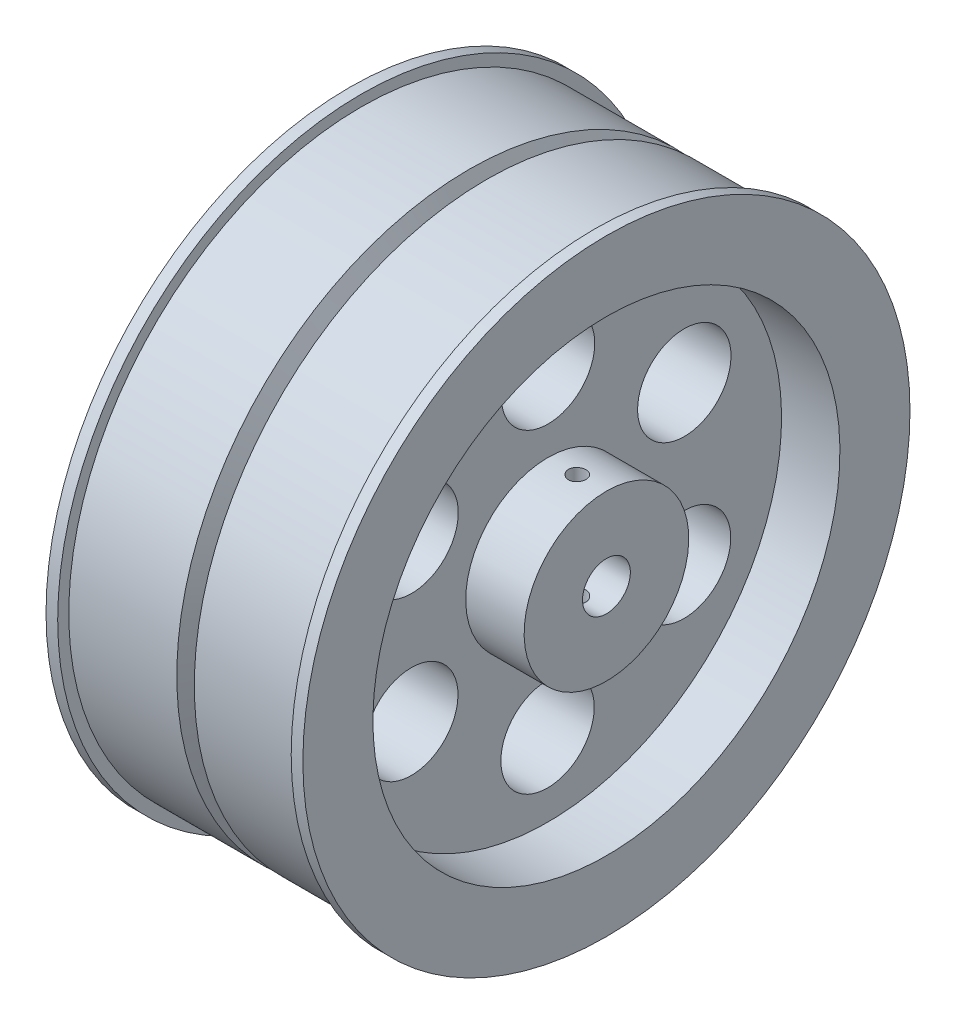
from build123d import *

# Parameters (mm, degrees)
SKETCH2_R               = 8
CUT_EXTRUDE1_DEPTH      = 84.709079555
CUT_EXTRUDE2_DEPTH      = 10
CUT_EXTRUDE2_DEPTH_BACK = 19
SKETCH4_R               = 1.5


with BuildPart() as part:
    # Sketch1 → Revolve1 (revolve)
    with BuildSketch(Plane.XY):
        Polygon((0, 0), (0, 10), (10, 10), (10, 35.9), (0, 35.9), (0, 45.9), (0, 47.9), (2, 47.9), (2, 46), (17, 46), (20.5, 46), (22, 43), (23.5, 46), (27, 46), (42, 46), (42, 47.9), (44, 47.9), (44, 45.9), (44, 35.9), (34, 35.9), (34, 10), (44, 10), (44, 0), align=None)
    revolve(axis=Axis((44, -4.1, 0), (-1, 0, 0)))

    # Sketch2 → Cut-Extrude1 (cut, through all)
    with BuildSketch(Plane(origin=(34, 0, 0), x_dir=(0, 0, -1), z_dir=(1, 0, 0))):
        with Locations(Location((0, 22.95, 0), (0, 0, 90))):
            Circle(SKETCH2_R)
        with Locations(Location((23.339384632, 9.425, 0), (0, 0, 90))):
            Circle(SKETCH2_R)
        with Locations(Location((23.296083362, -17.55, 0), (0, 0, 90))):
            Circle(SKETCH2_R)
        with Locations(Location((-0.08660254, -31, 0), (0, 0, 90))):
            Circle(SKETCH2_R)
        with Locations(Location((-23.425987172, -17.475, 0), (0, 0, 90))):
            Circle(SKETCH2_R)
        with Locations(Location((-23.382685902, 9.5, 0), (0, 0, 90))):
            Circle(SKETCH2_R)
    extrude(amount=-CUT_EXTRUDE1_DEPTH, mode=Mode.SUBTRACT)

    # Sketch4 → Cut-Extrude2 (cut, two sides: drawn at the far end of the back side and taken through both)
    with BuildSketch(Plane(origin=(0, 0, 0), x_dir=(1, 0, 0), z_dir=(0, 1, 0)).offset(-CUT_EXTRUDE2_DEPTH_BACK)):
        with Locations(Location((39.016935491, 0, 0), (0, 0, 90))):
            Circle(SKETCH4_R)
    extrude(amount=CUT_EXTRUDE2_DEPTH + CUT_EXTRUDE2_DEPTH_BACK, mode=Mode.SUBTRACT)


solid = part.part
